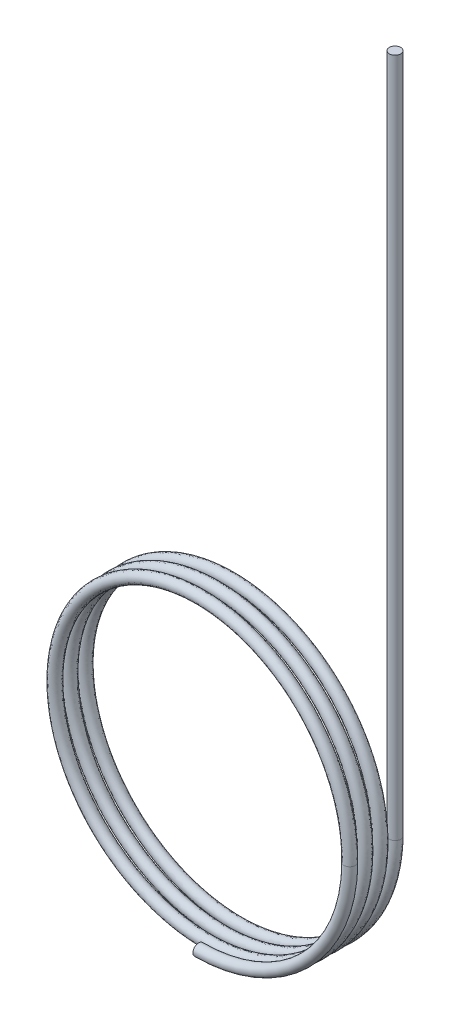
ISO-10303-21;
HEADER;
FILE_DESCRIPTION(('STEP AP214'),'2;1');
FILE_NAME('part.step','',(''),(''),'','','');
FILE_SCHEMA(('AUTOMOTIVE_DESIGN { 1 0 10303 214 1 1 1 1 }'));
ENDSEC;
DATA;
#1=APPLICATION_CONTEXT('core data for automotive mechanical design processes');
#2=APPLICATION_PROTOCOL_DEFINITION('international standard','automotive_design',2000,#1);
#3=PRODUCT_CONTEXT('',#1,'mechanical');
#4=PRODUCT('Part','Part','',(#3));
#5=PRODUCT_RELATED_PRODUCT_CATEGORY('part','',(#4));
#6=PRODUCT_DEFINITION_FORMATION('','',#4);
#7=PRODUCT_DEFINITION_CONTEXT('part definition',#1,'design');
#8=PRODUCT_DEFINITION('design','',#6,#7);
#9=PRODUCT_DEFINITION_SHAPE('','',#8);
#10=(LENGTH_UNIT() NAMED_UNIT(*) SI_UNIT(.MILLI.,.METRE.));
#11=(NAMED_UNIT(*) PLANE_ANGLE_UNIT() SI_UNIT($,.RADIAN.));
#12=(NAMED_UNIT(*) SI_UNIT($,.STERADIAN.) SOLID_ANGLE_UNIT());
#13=UNCERTAINTY_MEASURE_WITH_UNIT(LENGTH_MEASURE(1.E-05),#10,'distance_accuracy_value','');
#14=(GEOMETRIC_REPRESENTATION_CONTEXT(3) GLOBAL_UNCERTAINTY_ASSIGNED_CONTEXT((#13)) GLOBAL_UNIT_ASSIGNED_CONTEXT((#10,
#11,#12)) REPRESENTATION_CONTEXT('',''));
#15=CARTESIAN_POINT('',(0.,0.,0.));
#16=DIRECTION('',(0.,0.,1.));
#17=DIRECTION('',(1.,0.,0.));
#18=AXIS2_PLACEMENT_3D('',#15,#16,#17);
#19=CARTESIAN_POINT('',(20.,0.,0.750000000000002));
#20=CARTESIAN_POINT('',(20.,-11.5470053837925,0.916666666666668));
#21=CARTESIAN_POINT('',(10.,-17.3205080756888,1.08333333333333));
#22=CARTESIAN_POINT('',(0.,-23.094010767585,1.25));
#23=CARTESIAN_POINT('',(-9.99999999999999,-17.3205080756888,1.41666666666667));
#24=CARTESIAN_POINT('',(-20.,-11.5470053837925,1.58333333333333));
#25=CARTESIAN_POINT('',(-20.,0.,1.75));
#26=CARTESIAN_POINT('',(-20.,11.5470053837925,1.91666666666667));
#27=CARTESIAN_POINT('',(-10.,17.3205080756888,2.08333333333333));
#28=CARTESIAN_POINT('',(0.,23.094010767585,2.25));
#29=CARTESIAN_POINT('',(9.99999999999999,17.3205080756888,2.41666666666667));
#30=CARTESIAN_POINT('',(20.,11.5470053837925,2.58333333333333));
#31=CARTESIAN_POINT('',(20.,0.,2.75));
#32=CARTESIAN_POINT('',(20.,-11.5470053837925,2.91666666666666));
#33=CARTESIAN_POINT('',(10.,-17.3205080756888,3.08333333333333));
#34=CARTESIAN_POINT('',(0.,-23.094010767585,3.25));
#35=CARTESIAN_POINT('',(-9.99999999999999,-17.3205080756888,3.41666666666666));
#36=CARTESIAN_POINT('',(-20.,-11.5470053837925,3.58333333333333));
#37=CARTESIAN_POINT('',(-20.,0.,3.75));
#38=CARTESIAN_POINT('',(-20.,11.5470053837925,3.91666666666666));
#39=CARTESIAN_POINT('',(-10.,17.3205080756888,4.08333333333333));
#40=CARTESIAN_POINT('',(0.,23.094010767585,4.24999999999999));
#41=CARTESIAN_POINT('',(9.99999999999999,17.3205080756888,4.41666666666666));
#42=CARTESIAN_POINT('',(20.,11.5470053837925,4.58333333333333));
#43=CARTESIAN_POINT('',(20.,0.,4.74999999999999));
#44=CARTESIAN_POINT('',(20.,-11.5470053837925,4.91666666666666));
#45=CARTESIAN_POINT('',(10.,-17.3205080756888,5.08333333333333));
#46=CARTESIAN_POINT('',(0.,-23.094010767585,5.24999999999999));
#47=CARTESIAN_POINT('',(-9.99999999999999,-17.3205080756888,5.41666666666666));
#48=CARTESIAN_POINT('',(-20.,-11.5470053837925,5.58333333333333));
#49=CARTESIAN_POINT('',(-20.,0.,5.74999999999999));
#50=CARTESIAN_POINT('',(-20.,11.5470053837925,5.91666666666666));
#51=CARTESIAN_POINT('',(-10.,17.3205080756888,6.08333333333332));
#52=CARTESIAN_POINT('',(0.,23.094010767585,6.24999999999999));
#53=CARTESIAN_POINT('',(9.99999999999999,17.3205080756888,6.41666666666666));
#54=CARTESIAN_POINT('',(20.,11.5470053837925,6.58333333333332));
#55=CARTESIAN_POINT('',(20.,0.,6.74999999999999));
#56=CARTESIAN_POINT('',(21.5,0.,0.750000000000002));
#57=CARTESIAN_POINT('',(21.5,-12.413030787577,0.916666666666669));
#58=CARTESIAN_POINT('',(10.75,-18.6195461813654,1.08333333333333));
#59=CARTESIAN_POINT('',(0.,-24.8260615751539,1.25));
#60=CARTESIAN_POINT('',(-10.75,-18.6195461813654,1.41666666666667));
#61=CARTESIAN_POINT('',(-21.5,-12.413030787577,1.58333333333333));
#62=CARTESIAN_POINT('',(-21.5,0.,1.75));
#63=CARTESIAN_POINT('',(-21.5,12.413030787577,1.91666666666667));
#64=CARTESIAN_POINT('',(-10.75,18.6195461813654,2.08333333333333));
#65=CARTESIAN_POINT('',(0.,24.8260615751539,2.25));
#66=CARTESIAN_POINT('',(10.75,18.6195461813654,2.41666666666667));
#67=CARTESIAN_POINT('',(21.5,12.413030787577,2.58333333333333));
#68=CARTESIAN_POINT('',(21.5,0.,2.75));
#69=CARTESIAN_POINT('',(21.5,-12.413030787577,2.91666666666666));
#70=CARTESIAN_POINT('',(10.75,-18.6195461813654,3.08333333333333));
#71=CARTESIAN_POINT('',(0.,-24.8260615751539,3.25));
#72=CARTESIAN_POINT('',(-10.75,-18.6195461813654,3.41666666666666));
#73=CARTESIAN_POINT('',(-21.5,-12.413030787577,3.58333333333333));
#74=CARTESIAN_POINT('',(-21.5,0.,3.75));
#75=CARTESIAN_POINT('',(-21.5,12.413030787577,3.91666666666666));
#76=CARTESIAN_POINT('',(-10.75,18.6195461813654,4.08333333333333));
#77=CARTESIAN_POINT('',(0.,24.8260615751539,4.24999999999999));
#78=CARTESIAN_POINT('',(10.75,18.6195461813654,4.41666666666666));
#79=CARTESIAN_POINT('',(21.5,12.413030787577,4.58333333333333));
#80=CARTESIAN_POINT('',(21.5,0.,4.74999999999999));
#81=CARTESIAN_POINT('',(21.5,-12.413030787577,4.91666666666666));
#82=CARTESIAN_POINT('',(10.75,-18.6195461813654,5.08333333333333));
#83=CARTESIAN_POINT('',(0.,-24.8260615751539,5.24999999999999));
#84=CARTESIAN_POINT('',(-10.75,-18.6195461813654,5.41666666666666));
#85=CARTESIAN_POINT('',(-21.5,-12.413030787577,5.58333333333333));
#86=CARTESIAN_POINT('',(-21.5,0.,5.74999999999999));
#87=CARTESIAN_POINT('',(-21.5,12.413030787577,5.91666666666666));
#88=CARTESIAN_POINT('',(-10.75,18.6195461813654,6.08333333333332));
#89=CARTESIAN_POINT('',(0.,24.8260615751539,6.24999999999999));
#90=CARTESIAN_POINT('',(10.75,18.6195461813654,6.41666666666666));
#91=CARTESIAN_POINT('',(21.5,12.413030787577,6.58333333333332));
#92=CARTESIAN_POINT('',(21.5,0.,6.74999999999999));
#93=CARTESIAN_POINT('',(21.5,0.,-0.750000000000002));
#94=CARTESIAN_POINT('',(21.5,-12.413030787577,-0.583333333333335));
#95=CARTESIAN_POINT('',(10.75,-18.6195461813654,-0.416666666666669));
#96=CARTESIAN_POINT('',(0.,-24.8260615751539,-0.250000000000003));
#97=CARTESIAN_POINT('',(-10.75,-18.6195461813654,-0.0833333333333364));
#98=CARTESIAN_POINT('',(-21.5,-12.413030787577,0.0833333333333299));
#99=CARTESIAN_POINT('',(-21.5,0.,0.249999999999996));
#100=CARTESIAN_POINT('',(-21.5,12.413030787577,0.416666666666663));
#101=CARTESIAN_POINT('',(-10.75,18.6195461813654,0.583333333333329));
#102=CARTESIAN_POINT('',(0.,24.8260615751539,0.749999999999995));
#103=CARTESIAN_POINT('',(10.75,18.6195461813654,0.916666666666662));
#104=CARTESIAN_POINT('',(21.5,12.413030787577,1.08333333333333));
#105=CARTESIAN_POINT('',(21.5,0.,1.24999999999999));
#106=CARTESIAN_POINT('',(21.5,-12.413030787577,1.41666666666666));
#107=CARTESIAN_POINT('',(10.75,-18.6195461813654,1.58333333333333));
#108=CARTESIAN_POINT('',(0.,-24.8260615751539,1.74999999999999));
#109=CARTESIAN_POINT('',(-10.75,-18.6195461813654,1.91666666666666));
#110=CARTESIAN_POINT('',(-21.5,-12.413030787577,2.08333333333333));
#111=CARTESIAN_POINT('',(-21.5,0.,2.24999999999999));
#112=CARTESIAN_POINT('',(-21.5,12.413030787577,2.41666666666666));
#113=CARTESIAN_POINT('',(-10.75,18.6195461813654,2.58333333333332));
#114=CARTESIAN_POINT('',(0.,24.8260615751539,2.74999999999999));
#115=CARTESIAN_POINT('',(10.75,18.6195461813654,2.91666666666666));
#116=CARTESIAN_POINT('',(21.5,12.413030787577,3.08333333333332));
#117=CARTESIAN_POINT('',(21.5,0.,3.24999999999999));
#118=CARTESIAN_POINT('',(21.5,-12.413030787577,3.41666666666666));
#119=CARTESIAN_POINT('',(10.75,-18.6195461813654,3.58333333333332));
#120=CARTESIAN_POINT('',(0.,-24.8260615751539,3.74999999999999));
#121=CARTESIAN_POINT('',(-10.75,-18.6195461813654,3.91666666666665));
#122=CARTESIAN_POINT('',(-21.5,-12.413030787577,4.08333333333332));
#123=CARTESIAN_POINT('',(-21.5,0.,4.24999999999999));
#124=CARTESIAN_POINT('',(-21.5,12.413030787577,4.41666666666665));
#125=CARTESIAN_POINT('',(-10.75,18.6195461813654,4.58333333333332));
#126=CARTESIAN_POINT('',(0.,24.8260615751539,4.74999999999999));
#127=CARTESIAN_POINT('',(10.75,18.6195461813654,4.91666666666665));
#128=CARTESIAN_POINT('',(21.5,12.413030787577,5.08333333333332));
#129=CARTESIAN_POINT('',(21.5,0.,5.24999999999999));
#130=CARTESIAN_POINT('',(20.,0.,-0.750000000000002));
#131=CARTESIAN_POINT('',(20.,-11.5470053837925,-0.583333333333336));
#132=CARTESIAN_POINT('',(10.,-17.3205080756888,-0.416666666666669));
#133=CARTESIAN_POINT('',(0.,-23.094010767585,-0.250000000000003));
#134=CARTESIAN_POINT('',(-9.99999999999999,-17.3205080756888,-0.0833333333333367));
#135=CARTESIAN_POINT('',(-20.,-11.5470053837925,0.0833333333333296));
#136=CARTESIAN_POINT('',(-20.,0.,0.249999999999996));
#137=CARTESIAN_POINT('',(-20.,11.5470053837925,0.416666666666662));
#138=CARTESIAN_POINT('',(-10.,17.3205080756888,0.583333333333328));
#139=CARTESIAN_POINT('',(0.,23.094010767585,0.749999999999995));
#140=CARTESIAN_POINT('',(9.99999999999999,17.3205080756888,0.916666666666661));
#141=CARTESIAN_POINT('',(20.,11.5470053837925,1.08333333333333));
#142=CARTESIAN_POINT('',(20.,0.,1.24999999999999));
#143=CARTESIAN_POINT('',(20.,-11.5470053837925,1.41666666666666));
#144=CARTESIAN_POINT('',(10.,-17.3205080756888,1.58333333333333));
#145=CARTESIAN_POINT('',(0.,-23.094010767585,1.74999999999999));
#146=CARTESIAN_POINT('',(-9.99999999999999,-17.3205080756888,1.91666666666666));
#147=CARTESIAN_POINT('',(-20.,-11.5470053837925,2.08333333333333));
#148=CARTESIAN_POINT('',(-20.,0.,2.24999999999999));
#149=CARTESIAN_POINT('',(-20.,11.5470053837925,2.41666666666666));
#150=CARTESIAN_POINT('',(-10.,17.3205080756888,2.58333333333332));
#151=CARTESIAN_POINT('',(0.,23.094010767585,2.74999999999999));
#152=CARTESIAN_POINT('',(9.99999999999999,17.3205080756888,2.91666666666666));
#153=CARTESIAN_POINT('',(20.,11.5470053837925,3.08333333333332));
#154=CARTESIAN_POINT('',(20.,0.,3.24999999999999));
#155=CARTESIAN_POINT('',(20.,-11.5470053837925,3.41666666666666));
#156=CARTESIAN_POINT('',(10.,-17.3205080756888,3.58333333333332));
#157=CARTESIAN_POINT('',(0.,-23.094010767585,3.74999999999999));
#158=CARTESIAN_POINT('',(-9.99999999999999,-17.3205080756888,3.91666666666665));
#159=CARTESIAN_POINT('',(-20.,-11.5470053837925,4.08333333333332));
#160=CARTESIAN_POINT('',(-20.,0.,4.24999999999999));
#161=CARTESIAN_POINT('',(-20.,11.5470053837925,4.41666666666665));
#162=CARTESIAN_POINT('',(-10.,17.3205080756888,4.58333333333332));
#163=CARTESIAN_POINT('',(0.,23.094010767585,4.74999999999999));
#164=CARTESIAN_POINT('',(9.99999999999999,17.3205080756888,4.91666666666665));
#165=CARTESIAN_POINT('',(20.,11.5470053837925,5.08333333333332));
#166=CARTESIAN_POINT('',(20.,0.,5.24999999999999));
#167=CARTESIAN_POINT('',(18.5,0.,-0.750000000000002));
#168=CARTESIAN_POINT('',(18.5,-10.6809799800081,-0.583333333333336));
#169=CARTESIAN_POINT('',(9.25,-16.0214699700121,-0.41666666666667));
#170=CARTESIAN_POINT('',(0.,-21.3619599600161,-0.250000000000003));
#171=CARTESIAN_POINT('',(-9.24999999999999,-16.0214699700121,-0.083333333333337));
#172=CARTESIAN_POINT('',(-18.5,-10.6809799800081,0.0833333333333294));
#173=CARTESIAN_POINT('',(-18.5,0.,0.249999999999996));
#174=CARTESIAN_POINT('',(-18.5,10.6809799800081,0.416666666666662));
#175=CARTESIAN_POINT('',(-9.25000000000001,16.0214699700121,0.583333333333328));
#176=CARTESIAN_POINT('',(0.,21.3619599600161,0.749999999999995));
#177=CARTESIAN_POINT('',(9.24999999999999,16.0214699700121,0.916666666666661));
#178=CARTESIAN_POINT('',(18.5,10.6809799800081,1.08333333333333));
#179=CARTESIAN_POINT('',(18.5,0.,1.24999999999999));
#180=CARTESIAN_POINT('',(18.5,-10.6809799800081,1.41666666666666));
#181=CARTESIAN_POINT('',(9.25,-16.0214699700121,1.58333333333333));
#182=CARTESIAN_POINT('',(0.,-21.3619599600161,1.74999999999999));
#183=CARTESIAN_POINT('',(-9.24999999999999,-16.0214699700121,1.91666666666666));
#184=CARTESIAN_POINT('',(-18.5,-10.6809799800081,2.08333333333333));
#185=CARTESIAN_POINT('',(-18.5,0.,2.24999999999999));
#186=CARTESIAN_POINT('',(-18.5,10.6809799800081,2.41666666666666));
#187=CARTESIAN_POINT('',(-9.25000000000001,16.0214699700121,2.58333333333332));
#188=CARTESIAN_POINT('',(0.,21.3619599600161,2.74999999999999));
#189=CARTESIAN_POINT('',(9.24999999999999,16.0214699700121,2.91666666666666));
#190=CARTESIAN_POINT('',(18.5,10.6809799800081,3.08333333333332));
#191=CARTESIAN_POINT('',(18.5,0.,3.24999999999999));
#192=CARTESIAN_POINT('',(18.5,-10.6809799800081,3.41666666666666));
#193=CARTESIAN_POINT('',(9.25,-16.0214699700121,3.58333333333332));
#194=CARTESIAN_POINT('',(0.,-21.3619599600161,3.74999999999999));
#195=CARTESIAN_POINT('',(-9.24999999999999,-16.0214699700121,3.91666666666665));
#196=CARTESIAN_POINT('',(-18.5,-10.6809799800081,4.08333333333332));
#197=CARTESIAN_POINT('',(-18.5,0.,4.24999999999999));
#198=CARTESIAN_POINT('',(-18.5,10.6809799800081,4.41666666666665));
#199=CARTESIAN_POINT('',(-9.25000000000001,16.0214699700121,4.58333333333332));
#200=CARTESIAN_POINT('',(0.,21.3619599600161,4.74999999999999));
#201=CARTESIAN_POINT('',(9.24999999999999,16.0214699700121,4.91666666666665));
#202=CARTESIAN_POINT('',(18.5,10.6809799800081,5.08333333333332));
#203=CARTESIAN_POINT('',(18.5,0.,5.24999999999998));
#204=CARTESIAN_POINT('',(18.5,0.,0.750000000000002));
#205=CARTESIAN_POINT('',(18.5,-10.6809799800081,0.916666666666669));
#206=CARTESIAN_POINT('',(9.25,-16.0214699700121,1.08333333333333));
#207=CARTESIAN_POINT('',(0.,-21.3619599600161,1.25));
#208=CARTESIAN_POINT('',(-9.24999999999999,-16.0214699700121,1.41666666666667));
#209=CARTESIAN_POINT('',(-18.5,-10.6809799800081,1.58333333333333));
#210=CARTESIAN_POINT('',(-18.5,0.,1.75));
#211=CARTESIAN_POINT('',(-18.5,10.6809799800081,1.91666666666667));
#212=CARTESIAN_POINT('',(-9.25000000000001,16.0214699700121,2.08333333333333));
#213=CARTESIAN_POINT('',(0.,21.3619599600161,2.25));
#214=CARTESIAN_POINT('',(9.24999999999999,16.0214699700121,2.41666666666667));
#215=CARTESIAN_POINT('',(18.5,10.6809799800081,2.58333333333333));
#216=CARTESIAN_POINT('',(18.5,0.,2.75));
#217=CARTESIAN_POINT('',(18.5,-10.6809799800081,2.91666666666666));
#218=CARTESIAN_POINT('',(9.25,-16.0214699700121,3.08333333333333));
#219=CARTESIAN_POINT('',(0.,-21.3619599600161,3.25));
#220=CARTESIAN_POINT('',(-9.24999999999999,-16.0214699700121,3.41666666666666));
#221=CARTESIAN_POINT('',(-18.5,-10.6809799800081,3.58333333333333));
#222=CARTESIAN_POINT('',(-18.5,0.,3.75));
#223=CARTESIAN_POINT('',(-18.5,10.6809799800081,3.91666666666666));
#224=CARTESIAN_POINT('',(-9.25000000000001,16.0214699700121,4.08333333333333));
#225=CARTESIAN_POINT('',(0.,21.3619599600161,4.24999999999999));
#226=CARTESIAN_POINT('',(9.24999999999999,16.0214699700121,4.41666666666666));
#227=CARTESIAN_POINT('',(18.5,10.6809799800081,4.58333333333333));
#228=CARTESIAN_POINT('',(18.5,0.,4.74999999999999));
#229=CARTESIAN_POINT('',(18.5,-10.6809799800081,4.91666666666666));
#230=CARTESIAN_POINT('',(9.25,-16.0214699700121,5.08333333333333));
#231=CARTESIAN_POINT('',(0.,-21.3619599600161,5.24999999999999));
#232=CARTESIAN_POINT('',(-9.24999999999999,-16.0214699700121,5.41666666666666));
#233=CARTESIAN_POINT('',(-18.5,-10.6809799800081,5.58333333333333));
#234=CARTESIAN_POINT('',(-18.5,0.,5.74999999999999));
#235=CARTESIAN_POINT('',(-18.5,10.6809799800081,5.91666666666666));
#236=CARTESIAN_POINT('',(-9.25000000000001,16.0214699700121,6.08333333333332));
#237=CARTESIAN_POINT('',(0.,21.3619599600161,6.24999999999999));
#238=CARTESIAN_POINT('',(9.24999999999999,16.0214699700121,6.41666666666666));
#239=CARTESIAN_POINT('',(18.5,10.6809799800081,6.58333333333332));
#240=CARTESIAN_POINT('',(18.5,0.,6.74999999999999));
#241=CARTESIAN_POINT('',(20.,0.,0.750000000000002));
#242=CARTESIAN_POINT('',(20.,-11.5470053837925,0.916666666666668));
#243=CARTESIAN_POINT('',(10.,-17.3205080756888,1.08333333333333));
#244=CARTESIAN_POINT('',(0.,-23.094010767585,1.25));
#245=CARTESIAN_POINT('',(-9.99999999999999,-17.3205080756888,1.41666666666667));
#246=CARTESIAN_POINT('',(-20.,-11.5470053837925,1.58333333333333));
#247=CARTESIAN_POINT('',(-20.,0.,1.75));
#248=CARTESIAN_POINT('',(-20.,11.5470053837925,1.91666666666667));
#249=CARTESIAN_POINT('',(-10.,17.3205080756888,2.08333333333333));
#250=CARTESIAN_POINT('',(0.,23.094010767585,2.25));
#251=CARTESIAN_POINT('',(9.99999999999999,17.3205080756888,2.41666666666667));
#252=CARTESIAN_POINT('',(20.,11.5470053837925,2.58333333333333));
#253=CARTESIAN_POINT('',(20.,0.,2.75));
#254=CARTESIAN_POINT('',(20.,-11.5470053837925,2.91666666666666));
#255=CARTESIAN_POINT('',(10.,-17.3205080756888,3.08333333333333));
#256=CARTESIAN_POINT('',(0.,-23.094010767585,3.25));
#257=CARTESIAN_POINT('',(-9.99999999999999,-17.3205080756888,3.41666666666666));
#258=CARTESIAN_POINT('',(-20.,-11.5470053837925,3.58333333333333));
#259=CARTESIAN_POINT('',(-20.,0.,3.75));
#260=CARTESIAN_POINT('',(-20.,11.5470053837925,3.91666666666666));
#261=CARTESIAN_POINT('',(-10.,17.3205080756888,4.08333333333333));
#262=CARTESIAN_POINT('',(0.,23.094010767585,4.24999999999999));
#263=CARTESIAN_POINT('',(9.99999999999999,17.3205080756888,4.41666666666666));
#264=CARTESIAN_POINT('',(20.,11.5470053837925,4.58333333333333));
#265=CARTESIAN_POINT('',(20.,0.,4.74999999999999));
#266=CARTESIAN_POINT('',(20.,-11.5470053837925,4.91666666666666));
#267=CARTESIAN_POINT('',(10.,-17.3205080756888,5.08333333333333));
#268=CARTESIAN_POINT('',(0.,-23.094010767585,5.24999999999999));
#269=CARTESIAN_POINT('',(-9.99999999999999,-17.3205080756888,5.41666666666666));
#270=CARTESIAN_POINT('',(-20.,-11.5470053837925,5.58333333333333));
#271=CARTESIAN_POINT('',(-20.,0.,5.74999999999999));
#272=CARTESIAN_POINT('',(-20.,11.5470053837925,5.91666666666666));
#273=CARTESIAN_POINT('',(-10.,17.3205080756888,6.08333333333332));
#274=CARTESIAN_POINT('',(0.,23.094010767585,6.24999999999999));
#275=CARTESIAN_POINT('',(9.99999999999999,17.3205080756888,6.41666666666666));
#276=CARTESIAN_POINT('',(20.,11.5470053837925,6.58333333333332));
#277=CARTESIAN_POINT('',(20.,0.,6.74999999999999));
#278=(BOUNDED_SURFACE() B_SPLINE_SURFACE(3,2,((#19,#20,#21,#22,#23,#24,#25,#26,#27,#28,#29,#30,
#31,#32,#33,#34,#35,#36,#37,#38,#39,#40,#41,#42,#43,#44,#45,#46,#47,#48,#49,#50,#51,#52,#53,#54,
#55),(#56,#57,#58,#59,#60,#61,#62,#63,#64,#65,#66,#67,#68,#69,#70,#71,#72,#73,#74,#75,#76,#77,
#78,#79,#80,#81,#82,#83,#84,#85,#86,#87,#88,#89,#90,#91,#92),(#93,#94,#95,#96,#97,#98,#99,#100,
#101,#102,#103,#104,#105,#106,#107,#108,#109,#110,#111,#112,#113,#114,#115,#116,#117,#118,#119,
#120,#121,#122,#123,#124,#125,#126,#127,#128,#129),(#130,#131,#132,#133,#134,#135,#136,#137,
#138,#139,#140,#141,#142,#143,#144,#145,#146,#147,#148,#149,#150,#151,#152,#153,#154,#155,#156,
#157,#158,#159,#160,#161,#162,#163,#164,#165,#166),(#167,#168,#169,#170,#171,#172,#173,#174,
#175,#176,#177,#178,#179,#180,#181,#182,#183,#184,#185,#186,#187,#188,#189,#190,#191,#192,#193,
#194,#195,#196,#197,#198,#199,#200,#201,#202,#203),(#204,#205,#206,#207,#208,#209,#210,#211,
#212,#213,#214,#215,#216,#217,#218,#219,#220,#221,#222,#223,#224,#225,#226,#227,#228,#229,#230,
#231,#232,#233,#234,#235,#236,#237,#238,#239,#240),(#241,#242,#243,#244,#245,#246,#247,#248,
#249,#250,#251,#252,#253,#254,#255,#256,#257,#258,#259,#260,#261,#262,#263,#264,#265,#266,#267,
#268,#269,#270,#271,#272,#273,#274,#275,#276,#277)),.UNSPECIFIED.,.T.,.F.,
.F.) B_SPLINE_SURFACE_WITH_KNOTS((4,3,4),(3,2,2,2,2,2,2,2,2,2,2,2,2,2,2,2,2,2,3),(0.,0.5,1.),
(0.,0.0555555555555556,0.111111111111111,0.166666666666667,0.222222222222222,0.277777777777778,
0.333333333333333,0.388888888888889,0.444444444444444,0.5,0.555555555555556,0.611111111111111,
0.666666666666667,0.722222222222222,0.777777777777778,0.833333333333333,0.888888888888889,
0.944444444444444,1.),
.UNSPECIFIED.) GEOMETRIC_REPRESENTATION_ITEM() RATIONAL_B_SPLINE_SURFACE(((1.,0.866025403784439,
1.,0.866025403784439,1.,0.866025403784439,1.,0.866025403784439,1.,0.866025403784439,1.,
0.866025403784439,1.,0.866025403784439,1.,0.866025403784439,1.,0.866025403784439,1.,
0.866025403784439,1.,0.866025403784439,1.,0.866025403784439,1.,0.866025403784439,1.,
0.866025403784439,1.,0.866025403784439,1.,0.866025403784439,1.,0.866025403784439,1.,
0.866025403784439,1.),(0.333333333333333,0.288675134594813,0.333333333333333,0.288675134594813,
0.333333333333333,0.288675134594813,0.333333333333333,0.288675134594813,0.333333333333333,
0.288675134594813,0.333333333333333,0.288675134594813,0.333333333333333,0.288675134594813,
0.333333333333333,0.288675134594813,0.333333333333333,0.288675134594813,0.333333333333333,
0.288675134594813,0.333333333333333,0.288675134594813,0.333333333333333,0.288675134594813,
0.333333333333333,0.288675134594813,0.333333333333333,0.288675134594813,0.333333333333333,
0.288675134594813,0.333333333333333,0.288675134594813,0.333333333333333,0.288675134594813,
0.333333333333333,0.288675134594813,0.333333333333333),(0.333333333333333,0.288675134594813,
0.333333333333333,0.288675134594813,0.333333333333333,0.288675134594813,0.333333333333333,
0.288675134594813,0.333333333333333,0.288675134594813,0.333333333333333,0.288675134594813,
0.333333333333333,0.288675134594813,0.333333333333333,0.288675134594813,0.333333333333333,
0.288675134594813,0.333333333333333,0.288675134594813,0.333333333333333,0.288675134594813,
0.333333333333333,0.288675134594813,0.333333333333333,0.288675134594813,0.333333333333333,
0.288675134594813,0.333333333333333,0.288675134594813,0.333333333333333,0.288675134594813,
0.333333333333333,0.288675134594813,0.333333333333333,0.288675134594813,0.333333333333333),(1.,
0.866025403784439,1.,0.866025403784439,1.,0.866025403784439,1.,0.866025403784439,1.,
0.866025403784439,1.,0.866025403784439,1.,0.866025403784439,1.,0.866025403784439,1.,
0.866025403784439,1.,0.866025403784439,1.,0.866025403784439,1.,0.866025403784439,1.,
0.866025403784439,1.,0.866025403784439,1.,0.866025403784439,1.,0.866025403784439,1.,
0.866025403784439,1.,0.866025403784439,1.),(0.333333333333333,0.288675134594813,
0.333333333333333,0.288675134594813,0.333333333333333,0.288675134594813,0.333333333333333,
0.288675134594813,0.333333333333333,0.288675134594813,0.333333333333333,0.288675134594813,
0.333333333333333,0.288675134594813,0.333333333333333,0.288675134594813,0.333333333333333,
0.288675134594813,0.333333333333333,0.288675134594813,0.333333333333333,0.288675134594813,
0.333333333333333,0.288675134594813,0.333333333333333,0.288675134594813,0.333333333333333,
0.288675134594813,0.333333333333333,0.288675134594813,0.333333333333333,0.288675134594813,
0.333333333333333,0.288675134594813,0.333333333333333,0.288675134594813,0.333333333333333),
(0.333333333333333,0.288675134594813,0.333333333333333,0.288675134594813,0.333333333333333,
0.288675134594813,0.333333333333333,0.288675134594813,0.333333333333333,0.288675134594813,
0.333333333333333,0.288675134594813,0.333333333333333,0.288675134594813,0.333333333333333,
0.288675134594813,0.333333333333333,0.288675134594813,0.333333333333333,0.288675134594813,
0.333333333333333,0.288675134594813,0.333333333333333,0.288675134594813,0.333333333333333,
0.288675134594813,0.333333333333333,0.288675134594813,0.333333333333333,0.288675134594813,
0.333333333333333,0.288675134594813,0.333333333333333,0.288675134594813,0.333333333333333,
0.288675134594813,0.333333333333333),(1.,0.866025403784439,1.,0.866025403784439,1.,
0.866025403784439,1.,0.866025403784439,1.,0.866025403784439,1.,0.866025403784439,1.,
0.866025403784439,1.,0.866025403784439,1.,0.866025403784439,1.,0.866025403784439,1.,
0.866025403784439,1.,0.866025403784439,1.,0.866025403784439,1.,0.866025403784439,1.,
0.866025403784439,1.,0.866025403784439,1.,0.866025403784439,1.,0.866025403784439,1.))) REPRESENTATION_ITEM('') SURFACE());
#279=CARTESIAN_POINT('',(20.,-8.37956006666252E-13,6.));
#280=DIRECTION('',(0.,1.,0.));
#281=DIRECTION('',(0.,0.,1.));
#282=AXIS2_PLACEMENT_3D('',#279,#280,#281);
#283=CIRCLE('',#282,0.750000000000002);
#284=CARTESIAN_POINT('',(20.,-8.37956006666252E-13,6.75));
#285=VERTEX_POINT('',#284);
#286=CARTESIAN_POINT('',(20.75,-8.70328738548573E-13,6.));
#287=VERTEX_POINT('',#286);
#288=EDGE_CURVE('E11',#285,#287,#283,.T.);
#289=CARTESIAN_POINT('',(19.25,-8.07413408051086E-13,6.));
#290=VERTEX_POINT('',#289);
#291=EDGE_CURVE('E46',#287,#290,#283,.T.);
#292=EDGE_CURVE('E39',#290,#285,#283,.T.);
#293=CARTESIAN_POINT('',(20.,0.,0.));
#294=DIRECTION('',(0.,1.,0.));
#295=DIRECTION('',(0.,0.,1.));
#296=AXIS2_PLACEMENT_3D('',#293,#294,#295);
#297=CIRCLE('',#296,0.750000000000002);
#298=CARTESIAN_POINT('',(20.,0.,-0.750000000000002));
#299=VERTEX_POINT('',#298);
#300=EDGE_CURVE('E86',#299,#299,#297,.T.);
#301=CARTESIAN_POINT('',(0.,-20.0294886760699,5.24299978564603));
#302=VERTEX_POINT('',#301);
#303=VERTEX_LOOP('',#302);
#304=FACE_BOUND('',#303,.T.);
#305=ORIENTED_EDGE('',*,*,#288,.T.);
#306=ORIENTED_EDGE('',*,*,#291,.T.);
#307=ORIENTED_EDGE('',*,*,#292,.T.);
#308=EDGE_LOOP('',(#305,#306,#307));
#309=FACE_BOUND('',#308,.T.);
#310=ORIENTED_EDGE('',*,*,#300,.F.);
#311=EDGE_LOOP('',(#310));
#312=FACE_BOUND('',#311,.T.);
#313=ADVANCED_FACE('F33',(#304,#309,#312),#278,.F.);
#314=CARTESIAN_POINT('',(20.,90.,0.));
#315=DIRECTION('',(0.,-1.,0.));
#316=DIRECTION('',(0.,0.,-1.));
#317=AXIS2_PLACEMENT_3D('',#314,#315,#316);
#318=CYLINDRICAL_SURFACE('',#317,0.750000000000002);
#319=CARTESIAN_POINT('',(20.,90.,0.));
#320=DIRECTION('',(0.,1.,0.));
#321=DIRECTION('',(0.,0.,1.));
#322=AXIS2_PLACEMENT_3D('',#319,#320,#321);
#323=CIRCLE('',#322,0.750000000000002);
#324=CARTESIAN_POINT('',(20.,90.,-0.750000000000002));
#325=VERTEX_POINT('',#324);
#326=EDGE_CURVE('E83',#325,#325,#323,.T.);
#327=CARTESIAN_POINT('',(20.,90.,-0.750000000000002));
#328=CARTESIAN_POINT('',(20.,89.0625,-0.750000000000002));
#329=CARTESIAN_POINT('',(20.,88.125,-0.750000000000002));
#330=CARTESIAN_POINT('',(20.,86.25,-0.750000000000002));
#331=CARTESIAN_POINT('',(20.,85.3125,-0.750000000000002));
#332=CARTESIAN_POINT('',(20.,83.4375,-0.750000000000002));
#333=CARTESIAN_POINT('',(20.,82.5,-0.750000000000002));
#334=CARTESIAN_POINT('',(20.,80.625,-0.750000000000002));
#335=CARTESIAN_POINT('',(20.,79.6875,-0.750000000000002));
#336=CARTESIAN_POINT('',(20.,77.8125,-0.750000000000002));
#337=CARTESIAN_POINT('',(20.,76.875,-0.750000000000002));
#338=CARTESIAN_POINT('',(20.,75.,-0.750000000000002));
#339=CARTESIAN_POINT('',(20.,74.0625,-0.750000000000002));
#340=CARTESIAN_POINT('',(20.,72.1875,-0.750000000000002));
#341=CARTESIAN_POINT('',(20.,71.25,-0.750000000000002));
#342=CARTESIAN_POINT('',(20.,69.375,-0.750000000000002));
#343=CARTESIAN_POINT('',(20.,68.4375,-0.750000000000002));
#344=CARTESIAN_POINT('',(20.,66.5625,-0.750000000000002));
#345=CARTESIAN_POINT('',(20.,65.625,-0.750000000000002));
#346=CARTESIAN_POINT('',(20.,63.75,-0.750000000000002));
#347=CARTESIAN_POINT('',(20.,62.8125,-0.750000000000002));
#348=CARTESIAN_POINT('',(20.,60.9375,-0.750000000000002));
#349=CARTESIAN_POINT('',(20.,60.,-0.750000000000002));
#350=CARTESIAN_POINT('',(20.,58.125,-0.750000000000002));
#351=CARTESIAN_POINT('',(20.,57.1875,-0.750000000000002));
#352=CARTESIAN_POINT('',(20.,55.3125,-0.750000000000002));
#353=CARTESIAN_POINT('',(20.,54.375,-0.750000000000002));
#354=CARTESIAN_POINT('',(20.,52.5,-0.750000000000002));
#355=CARTESIAN_POINT('',(20.,51.5625,-0.750000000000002));
#356=CARTESIAN_POINT('',(20.,49.6875,-0.750000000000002));
#357=CARTESIAN_POINT('',(20.,48.75,-0.750000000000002));
#358=CARTESIAN_POINT('',(20.,46.875,-0.750000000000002));
#359=CARTESIAN_POINT('',(20.,45.9375,-0.750000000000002));
#360=CARTESIAN_POINT('',(20.,44.0625,-0.750000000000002));
#361=CARTESIAN_POINT('',(20.,43.125,-0.750000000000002));
#362=CARTESIAN_POINT('',(20.,41.25,-0.750000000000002));
#363=CARTESIAN_POINT('',(20.,40.3125,-0.750000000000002));
#364=CARTESIAN_POINT('',(20.,38.4375,-0.750000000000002));
#365=CARTESIAN_POINT('',(20.,37.5,-0.750000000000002));
#366=CARTESIAN_POINT('',(20.,35.625,-0.750000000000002));
#367=CARTESIAN_POINT('',(20.,34.6875,-0.750000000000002));
#368=CARTESIAN_POINT('',(20.,32.8125,-0.750000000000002));
#369=CARTESIAN_POINT('',(20.,31.875,-0.750000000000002));
#370=CARTESIAN_POINT('',(20.,30.,-0.750000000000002));
#371=CARTESIAN_POINT('',(20.,29.0625,-0.750000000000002));
#372=CARTESIAN_POINT('',(20.,27.1875,-0.750000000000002));
#373=CARTESIAN_POINT('',(20.,26.25,-0.750000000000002));
#374=CARTESIAN_POINT('',(20.,24.375,-0.750000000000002));
#375=CARTESIAN_POINT('',(20.,23.4375,-0.750000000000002));
#376=CARTESIAN_POINT('',(20.,21.5625,-0.750000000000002));
#377=CARTESIAN_POINT('',(20.,20.625,-0.750000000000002));
#378=CARTESIAN_POINT('',(20.,18.75,-0.750000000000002));
#379=CARTESIAN_POINT('',(20.,17.8125,-0.750000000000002));
#380=CARTESIAN_POINT('',(20.,15.9375,-0.750000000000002));
#381=CARTESIAN_POINT('',(20.,15.,-0.750000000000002));
#382=CARTESIAN_POINT('',(20.,13.125,-0.750000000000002));
#383=CARTESIAN_POINT('',(20.,12.1875,-0.750000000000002));
#384=CARTESIAN_POINT('',(20.,10.3125,-0.750000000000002));
#385=CARTESIAN_POINT('',(20.,9.375,-0.750000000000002));
#386=CARTESIAN_POINT('',(20.,7.5,-0.750000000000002));
#387=CARTESIAN_POINT('',(20.,6.5625,-0.750000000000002));
#388=CARTESIAN_POINT('',(20.,4.6875,-0.750000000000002));
#389=CARTESIAN_POINT('',(20.,3.75,-0.750000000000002));
#390=CARTESIAN_POINT('',(20.,1.875,-0.750000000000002));
#391=CARTESIAN_POINT('',(20.,0.9375,-0.750000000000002));
#392=CARTESIAN_POINT('',(20.,0.,-0.750000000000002));
#393=B_SPLINE_CURVE_WITH_KNOTS('',3,(#327,#328,#329,#330,#331,#332,#333,#334,#335,#336,#337,
#338,#339,#340,#341,#342,#343,#344,#345,#346,#347,#348,#349,#350,#351,#352,#353,#354,#355,#356,
#357,#358,#359,#360,#361,#362,#363,#364,#365,#366,#367,#368,#369,#370,#371,#372,#373,#374,#375,
#376,#377,#378,#379,#380,#381,#382,#383,#384,#385,#386,#387,#388,#389,#390,#391,#392),
.UNSPECIFIED.,.F.,.F.,(4,2,2,2,2,2,2,2,2,2,2,2,2,2,2,2,2,2,2,2,2,2,2,2,2,2,2,2,2,2,2,2,4),(0.,
2.81250000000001,5.62500000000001,8.4375,11.25,14.0625,16.875,19.6875,22.5,25.3125,28.125,
30.9375,33.75,36.5625,39.375,42.1875,45.,47.8125,50.625,53.4375,56.25,59.0625,61.875,64.6875,
67.5,70.3125,73.125,75.9375,78.75,81.5625,84.375,87.1875,90.),.UNSPECIFIED.);
#394=EDGE_CURVE('BSEAM110',#325,#299,#393,.T.);
#395=ORIENTED_EDGE('',*,*,#326,.F.);
#396=ORIENTED_EDGE('',*,*,#300,.T.);
#397=ORIENTED_EDGE('',*,*,#394,.T.);
#398=ORIENTED_EDGE('',*,*,#394,.F.);
#399=EDGE_LOOP('',(#395,#397,#396,#398));
#400=FACE_BOUND('',#399,.T.);
#401=ADVANCED_FACE('F110',(#400),#318,.T.);
#402=CARTESIAN_POINT('',(20.,90.,0.));
#403=DIRECTION('',(0.,1.,0.));
#404=DIRECTION('',(0.,0.,1.));
#405=AXIS2_PLACEMENT_3D('',#402,#403,#404);
#406=PLANE('',#405);
#407=ORIENTED_EDGE('',*,*,#326,.T.);
#408=EDGE_LOOP('',(#407));
#409=FACE_BOUND('',#408,.T.);
#410=ADVANCED_FACE('F107',(#409),#406,.T.);
#411=CARTESIAN_POINT('',(0.,0.,6.));
#412=DIRECTION('',(0.,0.,1.));
#413=DIRECTION('',(1.,0.,0.));
#414=AXIS2_PLACEMENT_3D('',#411,#412,#413);
#415=TOROIDAL_SURFACE('',#414,20.,0.750000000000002);
#416=CARTESIAN_POINT('',(0.,-20.,6.));
#417=DIRECTION('',(-1.,0.,0.));
#418=DIRECTION('',(0.,-1.,0.));
#419=AXIS2_PLACEMENT_3D('',#416,#417,#418);
#420=CIRCLE('',#419,0.750000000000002);
#421=CARTESIAN_POINT('',(0.,-19.9999961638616,5.25000000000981));
#422=VERTEX_POINT('',#421);
#423=EDGE_CURVE('E76',#422,#422,#420,.T.);
#424=ORIENTED_EDGE('',*,*,#423,.F.);
#425=EDGE_LOOP('',(#424));
#426=FACE_BOUND('',#425,.T.);
#427=ORIENTED_EDGE('',*,*,#288,.F.);
#428=ORIENTED_EDGE('',*,*,#292,.F.);
#429=ORIENTED_EDGE('',*,*,#291,.F.);
#430=EDGE_LOOP('',(#427,#428,#429));
#431=FACE_BOUND('',#430,.T.);
#432=ADVANCED_FACE('F60',(#426,#431),#415,.T.);
#433=CARTESIAN_POINT('',(0.,-20.,6.));
#434=DIRECTION('',(-1.,0.,0.));
#435=DIRECTION('',(0.,-1.,0.));
#436=AXIS2_PLACEMENT_3D('',#433,#434,#435);
#437=PLANE('',#436);
#438=ORIENTED_EDGE('',*,*,#423,.T.);
#439=EDGE_LOOP('',(#438));
#440=FACE_BOUND('',#439,.T.);
#441=ADVANCED_FACE('F106',(#440),#437,.T.);
#442=CLOSED_SHELL('',(#313,#401,#410,#432,#441));
#443=MANIFOLD_SOLID_BREP('B2',#442);
#444=ADVANCED_BREP_SHAPE_REPRESENTATION('',(#18,#443),#14);
#445=SHAPE_DEFINITION_REPRESENTATION(#9,#444);
ENDSEC;
END-ISO-10303-21;
